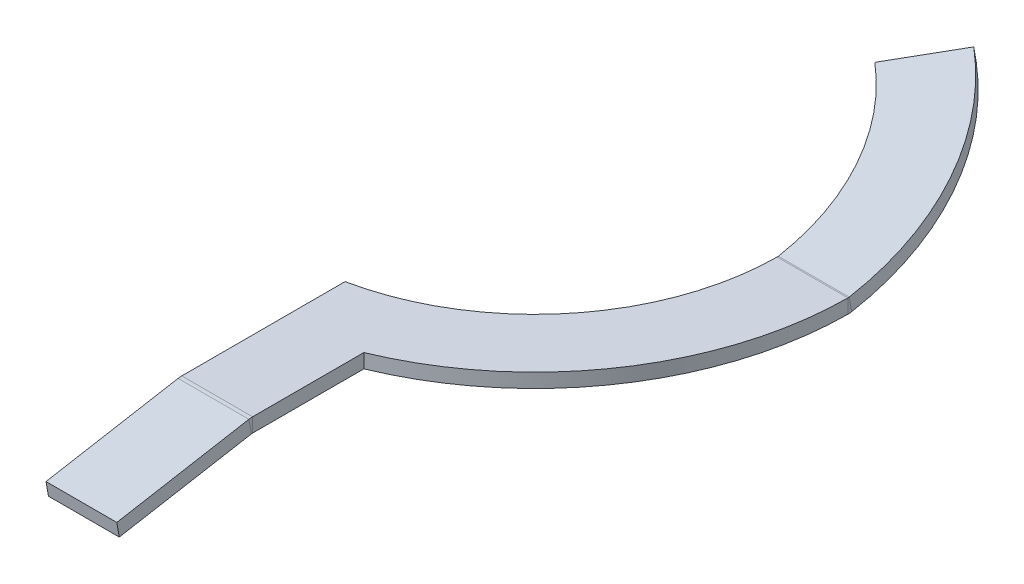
ISO-10303-21;
HEADER;
FILE_DESCRIPTION(('STEP AP214'),'2;1');
FILE_NAME('part.step','',(''),(''),'','','');
FILE_SCHEMA(('AUTOMOTIVE_DESIGN { 1 0 10303 214 1 1 1 1 }'));
ENDSEC;
DATA;
#1=APPLICATION_CONTEXT('core data for automotive mechanical design processes');
#2=APPLICATION_PROTOCOL_DEFINITION('international standard','automotive_design',2000,#1);
#3=PRODUCT_CONTEXT('',#1,'mechanical');
#4=PRODUCT('Part','Part','',(#3));
#5=PRODUCT_RELATED_PRODUCT_CATEGORY('part','',(#4));
#6=PRODUCT_DEFINITION_FORMATION('','',#4);
#7=PRODUCT_DEFINITION_CONTEXT('part definition',#1,'design');
#8=PRODUCT_DEFINITION('design','',#6,#7);
#9=PRODUCT_DEFINITION_SHAPE('','',#8);
#10=(LENGTH_UNIT() NAMED_UNIT(*) SI_UNIT(.MILLI.,.METRE.));
#11=(NAMED_UNIT(*) PLANE_ANGLE_UNIT() SI_UNIT($,.RADIAN.));
#12=(NAMED_UNIT(*) SI_UNIT($,.STERADIAN.) SOLID_ANGLE_UNIT());
#13=UNCERTAINTY_MEASURE_WITH_UNIT(LENGTH_MEASURE(1.E-05),#10,'distance_accuracy_value','');
#14=(GEOMETRIC_REPRESENTATION_CONTEXT(3) GLOBAL_UNCERTAINTY_ASSIGNED_CONTEXT((#13)) GLOBAL_UNIT_ASSIGNED_CONTEXT((#10,
#11,#12)) REPRESENTATION_CONTEXT('',''));
#15=CARTESIAN_POINT('',(0.,0.,0.));
#16=DIRECTION('',(0.,0.,1.));
#17=DIRECTION('',(1.,0.,0.));
#18=AXIS2_PLACEMENT_3D('',#15,#16,#17);
#19=CARTESIAN_POINT('',(-14.,4.,-152.249620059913));
#20=DIRECTION('',(0.,1.,0.));
#21=DIRECTION('',(0.,0.,1.));
#22=AXIS2_PLACEMENT_3D('',#19,#20,#21);
#23=PLANE('',#22);
#24=DIRECTION('',(0.,0.,1.));
#25=VECTOR('',#24,1.);
#26=CARTESIAN_POINT('',(0.,4.,0.));
#27=LINE('',#26,#25);
#28=CARTESIAN_POINT('',(0.,4.,-84.6848363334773));
#29=VERTEX_POINT('',#28);
#30=CARTESIAN_POINT('',(0.,4.,-38.5759841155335));
#31=VERTEX_POINT('',#30);
#32=EDGE_CURVE('E59',#29,#31,#27,.T.);
#33=ORIENTED_EDGE('',*,*,#32,.T.);
#34=DIRECTION('',(1.,0.,0.));
#35=VECTOR('',#34,1.);
#36=CARTESIAN_POINT('',(-14.,4.,-38.5759841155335));
#37=LINE('',#36,#35);
#38=CARTESIAN_POINT('',(20.,3.9999999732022,-38.5759841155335));
#39=VERTEX_POINT('',#38);
#40=EDGE_CURVE('E413',#31,#39,#37,.T.);
#41=ORIENTED_EDGE('',*,*,#40,.T.);
#42=DIRECTION('',(0.,0.,-1.));
#43=VECTOR('',#42,1.);
#44=CARTESIAN_POINT('',(20.,4.,0.));
#45=LINE('',#44,#43);
#46=CARTESIAN_POINT('',(20.,4.,-70.));
#47=VERTEX_POINT('',#46);
#48=EDGE_CURVE('E368',#39,#47,#45,.T.);
#49=ORIENTED_EDGE('',*,*,#48,.T.);
#50=CARTESIAN_POINT('',(-14.,4.,-152.249620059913));
#51=DIRECTION('',(0.,1.,0.));
#52=DIRECTION('',(0.,0.,1.));
#53=AXIS2_PLACEMENT_3D('',#50,#51,#52);
#54=CIRCLE('',#53,89.);
#55=CARTESIAN_POINT('',(74.998451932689,4.,-151.724688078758));
#56=VERTEX_POINT('',#55);
#57=EDGE_CURVE('E343',#47,#56,#54,.T.);
#58=ORIENTED_EDGE('',*,*,#57,.T.);
#59=DIRECTION('',(-1.,0.,0.));
#60=VECTOR('',#59,1.);
#61=CARTESIAN_POINT('',(-14.,4.,-151.724688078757));
#62=LINE('',#61,#60);
#63=CARTESIAN_POINT('',(54.9980032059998,3.99999989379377,-151.724688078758));
#64=VERTEX_POINT('',#63);
#65=EDGE_CURVE('E346',#56,#64,#62,.T.);
#66=ORIENTED_EDGE('',*,*,#65,.T.);
#67=CARTESIAN_POINT('',(-14.,4.,-152.249620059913));
#68=DIRECTION('',(0.,-1.,0.));
#69=DIRECTION('',(0.,0.,1.));
#70=AXIS2_PLACEMENT_3D('',#67,#68,#69);
#71=CIRCLE('',#70,69.);
#72=EDGE_CURVE('E344',#64,#29,#71,.T.);
#73=ORIENTED_EDGE('',*,*,#72,.T.);
#74=EDGE_LOOP('',(#33,#41,#49,#58,#66,#73));
#75=FACE_BOUND('',#74,.T.);
#76=ADVANCED_FACE('F55',(#75),#23,.T.);
#77=CARTESIAN_POINT('',(-14.,4.00030867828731,-151.901416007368));
#78=DIRECTION('',(0.,-0.984807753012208,-0.173648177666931));
#79=DIRECTION('',(0.,0.173648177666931,-0.984807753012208));
#80=AXIS2_PLACEMENT_3D('',#77,#78,#79);
#81=CYLINDRICAL_SURFACE('',#80,89.);
#82=CARTESIAN_POINT('',(-14.,4.00030867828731,-151.901416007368));
#83=DIRECTION('',(0.,0.984807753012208,0.173648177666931));
#84=DIRECTION('',(0.,-0.173648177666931,0.984807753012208));
#85=AXIS2_PLACEMENT_3D('',#82,#83,#84);
#86=CIRCLE('',#85,89.);
#87=CARTESIAN_POINT('',(74.9998314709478,4.03038449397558,-152.071984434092));
#88=VERTEX_POINT('',#87);
#89=CARTESIAN_POINT('',(43.2080972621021,15.8392863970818,-219.043595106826));
#90=VERTEX_POINT('',#89);
#91=EDGE_CURVE('E478',#88,#90,#86,.T.);
#92=ORIENTED_EDGE('',*,*,#91,.F.);
#93=CARTESIAN_POINT('',(74.9998314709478,0.0911533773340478,-152.766577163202));
#94=CARTESIAN_POINT('',(74.9998314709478,4.03038438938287,-152.071984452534));
#95=B_SPLINE_CURVE_WITH_KNOTS('',1,(#93,#94),.UNSPECIFIED.,.F.,.F.,(2,2),(0.,1.),.UNSPECIFIED.);
#96=CARTESIAN_POINT('',(74.9998314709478,0.0911534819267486,-152.766577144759));
#97=VERTEX_POINT('',#96);
#98=EDGE_CURVE('E422',#88,#97,#95,.F.);
#99=ORIENTED_EDGE('',*,*,#98,.T.);
#100=CARTESIAN_POINT('',(-14.,0.0610776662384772,-152.596008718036));
#101=DIRECTION('',(0.,0.984807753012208,0.173648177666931));
#102=DIRECTION('',(0.,-0.173648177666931,0.984807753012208));
#103=AXIS2_PLACEMENT_3D('',#100,#101,#102);
#104=CIRCLE('',#103,89.);
#105=CARTESIAN_POINT('',(43.2080972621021,11.9000553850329,-219.738187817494));
#106=VERTEX_POINT('',#105);
#107=EDGE_CURVE('E372',#97,#106,#104,.T.);
#108=ORIENTED_EDGE('',*,*,#107,.T.);
#109=DIRECTION('',(0.,-0.984807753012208,-0.173648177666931));
#110=VECTOR('',#109,1.);
#111=CARTESIAN_POINT('',(43.2080972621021,15.8392863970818,-219.043595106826));
#112=LINE('',#111,#110);
#113=EDGE_CURVE('E493',#90,#106,#112,.T.);
#114=ORIENTED_EDGE('',*,*,#113,.F.);
#115=EDGE_LOOP('',(#92,#99,#108,#114));
#116=FACE_BOUND('',#115,.T.);
#117=ADVANCED_FACE('F404',(#116),#81,.T.);
#118=CARTESIAN_POINT('',(-14.,4.00030867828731,-151.901416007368));
#119=DIRECTION('',(0.,-0.984807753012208,-0.173648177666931));
#120=DIRECTION('',(0.,0.173648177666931,-0.984807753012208));
#121=AXIS2_PLACEMENT_3D('',#118,#119,#120);
#122=CYLINDRICAL_SURFACE('',#121,69.);
#123=CARTESIAN_POINT('',(-14.,0.0610776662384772,-152.596008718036));
#124=DIRECTION('',(0.,-0.984807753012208,-0.173648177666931));
#125=DIRECTION('',(0.,-0.173648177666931,0.984807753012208));
#126=AXIS2_PLACEMENT_3D('',#123,#124,#125);
#127=CIRCLE('',#126,69.);
#128=CARTESIAN_POINT('',(30.3523450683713,9.23961095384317,-204.650057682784));
#129=VERTEX_POINT('',#128);
#130=CARTESIAN_POINT('',(54.9997826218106,0.091153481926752,-152.766577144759));
#131=VERTEX_POINT('',#130);
#132=EDGE_CURVE('E477',#129,#131,#127,.T.);
#133=ORIENTED_EDGE('',*,*,#132,.T.);
#134=CARTESIAN_POINT('',(54.9997826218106,4.03038438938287,-152.071984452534));
#135=CARTESIAN_POINT('',(54.9997826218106,0.0911533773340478,-152.766577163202));
#136=B_SPLINE_CURVE_WITH_KNOTS('',1,(#134,#135),.UNSPECIFIED.,.F.,.F.,(2,2),(0.,1.),.UNSPECIFIED.);
#137=CARTESIAN_POINT('',(54.9997826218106,4.03038438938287,-152.071984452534));
#138=VERTEX_POINT('',#137);
#139=EDGE_CURVE('E463',#131,#138,#136,.F.);
#140=ORIENTED_EDGE('',*,*,#139,.T.);
#141=CARTESIAN_POINT('',(-14.,4.00030867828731,-151.901416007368));
#142=DIRECTION('',(0.,-0.984807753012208,-0.173648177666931));
#143=DIRECTION('',(0.,-0.173648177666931,0.984807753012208));
#144=AXIS2_PLACEMENT_3D('',#141,#142,#143);
#145=CIRCLE('',#144,69.);
#146=CARTESIAN_POINT('',(30.3523450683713,13.178841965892,-203.955464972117));
#147=VERTEX_POINT('',#146);
#148=EDGE_CURVE('E490',#147,#138,#145,.T.);
#149=ORIENTED_EDGE('',*,*,#148,.F.);
#150=DIRECTION('',(0.,-0.984807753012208,-0.173648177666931));
#151=VECTOR('',#150,1.);
#152=CARTESIAN_POINT('',(30.3523450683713,13.178841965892,-203.955464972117));
#153=LINE('',#152,#151);
#154=EDGE_CURVE('E491',#147,#129,#153,.T.);
#155=ORIENTED_EDGE('',*,*,#154,.T.);
#156=EDGE_LOOP('',(#133,#140,#149,#155));
#157=FACE_BOUND('',#156,.T.);
#158=ADVANCED_FACE('F400',(#157),#122,.F.);
#159=CARTESIAN_POINT('',(-14.,0.0610776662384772,-152.596008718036));
#160=DIRECTION('',(0.,0.984807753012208,0.173648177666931));
#161=DIRECTION('',(0.,-0.173648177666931,0.984807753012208));
#162=AXIS2_PLACEMENT_3D('',#159,#160,#161);
#163=PLANE('',#162);
#164=ORIENTED_EDGE('',*,*,#107,.F.);
#165=DIRECTION('',(-1.,0.,0.));
#166=VECTOR('',#165,1.);
#167=CARTESIAN_POINT('',(-14.,0.0911534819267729,-152.766577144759));
#168=LINE('',#167,#166);
#169=EDGE_CURVE('E461',#97,#131,#168,.T.);
#170=ORIENTED_EDGE('',*,*,#169,.T.);
#171=ORIENTED_EDGE('',*,*,#132,.F.);
#172=DIRECTION('',(-0.64278760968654,-0.133022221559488,0.754406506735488));
#173=VECTOR('',#172,1.);
#174=CARTESIAN_POINT('',(43.2080972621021,11.9000553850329,-219.738187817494));
#175=LINE('',#174,#173);
#176=EDGE_CURVE('E474',#106,#129,#175,.T.);
#177=ORIENTED_EDGE('',*,*,#176,.F.);
#178=EDGE_LOOP('',(#164,#170,#171,#177));
#179=FACE_BOUND('',#178,.T.);
#180=ADVANCED_FACE('F395',(#179),#163,.F.);
#181=CARTESIAN_POINT('',(43.2080972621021,15.8392863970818,-219.043595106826));
#182=DIRECTION('',(0.766044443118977,-0.111618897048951,0.63302222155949));
#183=DIRECTION('',(0.64278760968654,0.133022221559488,-0.754406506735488));
#184=AXIS2_PLACEMENT_3D('',#181,#182,#183);
#185=PLANE('',#184);
#186=ORIENTED_EDGE('',*,*,#176,.T.);
#187=ORIENTED_EDGE('',*,*,#154,.F.);
#188=DIRECTION('',(-0.64278760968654,-0.133022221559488,0.754406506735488));
#189=VECTOR('',#188,1.);
#190=CARTESIAN_POINT('',(43.2080972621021,15.8392863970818,-219.043595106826));
#191=LINE('',#190,#189);
#192=EDGE_CURVE('E481',#90,#147,#191,.T.);
#193=ORIENTED_EDGE('',*,*,#192,.F.);
#194=ORIENTED_EDGE('',*,*,#113,.T.);
#195=EDGE_LOOP('',(#186,#187,#193,#194));
#196=FACE_BOUND('',#195,.T.);
#197=ADVANCED_FACE('F391',(#196),#185,.F.);
#198=CARTESIAN_POINT('',(-14.,4.00030867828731,-151.901416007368));
#199=DIRECTION('',(0.,0.984807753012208,0.173648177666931));
#200=DIRECTION('',(0.,-0.173648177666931,0.984807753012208));
#201=AXIS2_PLACEMENT_3D('',#198,#199,#200);
#202=PLANE('',#201);
#203=DIRECTION('',(-1.,0.,0.));
#204=VECTOR('',#203,1.);
#205=CARTESIAN_POINT('',(-14.,4.03038449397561,-152.071984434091));
#206=LINE('',#205,#204);
#207=EDGE_CURVE('E448',#88,#138,#206,.T.);
#208=ORIENTED_EDGE('',*,*,#207,.F.);
#209=ORIENTED_EDGE('',*,*,#91,.T.);
#210=ORIENTED_EDGE('',*,*,#192,.T.);
#211=ORIENTED_EDGE('',*,*,#148,.T.);
#212=EDGE_LOOP('',(#208,#209,#210,#211));
#213=FACE_BOUND('',#212,.T.);
#214=ADVANCED_FACE('F394',(#213),#202,.T.);
#215=CARTESIAN_POINT('',(20.,4.,0.));
#216=DIRECTION('',(-1.,0.,0.));
#217=DIRECTION('',(0.,0.,1.));
#218=AXIS2_PLACEMENT_3D('',#215,#216,#217);
#219=PLANE('',#218);
#220=DIRECTION('',(0.,1.,0.));
#221=VECTOR('',#220,1.);
#222=CARTESIAN_POINT('',(20.,4.,-38.5759841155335));
#223=LINE('',#222,#221);
#224=CARTESIAN_POINT('',(20.,0.,-38.5759841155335));
#225=VERTEX_POINT('',#224);
#226=EDGE_CURVE('E12',#225,#39,#223,.T.);
#227=ORIENTED_EDGE('',*,*,#226,.F.);
#228=DIRECTION('',(0.,0.,-1.));
#229=VECTOR('',#228,1.);
#230=CARTESIAN_POINT('',(20.,0.,0.));
#231=LINE('',#230,#229);
#232=CARTESIAN_POINT('',(20.,0.,-70.));
#233=VERTEX_POINT('',#232);
#234=EDGE_CURVE('E72',#225,#233,#231,.T.);
#235=ORIENTED_EDGE('',*,*,#234,.T.);
#236=DIRECTION('',(0.,-1.,0.));
#237=VECTOR('',#236,1.);
#238=CARTESIAN_POINT('',(20.,4.,-70.));
#239=LINE('',#238,#237);
#240=EDGE_CURVE('E331',#47,#233,#239,.T.);
#241=ORIENTED_EDGE('',*,*,#240,.F.);
#242=ORIENTED_EDGE('',*,*,#48,.F.);
#243=EDGE_LOOP('',(#227,#235,#241,#242));
#244=FACE_BOUND('',#243,.T.);
#245=ADVANCED_FACE('F57',(#244),#219,.F.);
#246=CARTESIAN_POINT('',(0.,4.,0.));
#247=DIRECTION('',(1.,0.,0.));
#248=DIRECTION('',(0.,0.,-1.));
#249=AXIS2_PLACEMENT_3D('',#246,#247,#248);
#250=PLANE('',#249);
#251=DIRECTION('',(0.,-1.,0.));
#252=VECTOR('',#251,1.);
#253=CARTESIAN_POINT('',(0.,4.,-38.5759841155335));
#254=LINE('',#253,#252);
#255=CARTESIAN_POINT('',(0.,0.,-38.5759841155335));
#256=VERTEX_POINT('',#255);
#257=EDGE_CURVE('E421',#31,#256,#254,.T.);
#258=ORIENTED_EDGE('',*,*,#257,.F.);
#259=ORIENTED_EDGE('',*,*,#32,.F.);
#260=DIRECTION('',(0.,-1.,0.));
#261=VECTOR('',#260,1.);
#262=CARTESIAN_POINT('',(0.,4.,-84.6848363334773));
#263=LINE('',#262,#261);
#264=CARTESIAN_POINT('',(0.,0.,-84.6848363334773));
#265=VERTEX_POINT('',#264);
#266=EDGE_CURVE('E341',#29,#265,#263,.T.);
#267=ORIENTED_EDGE('',*,*,#266,.T.);
#268=DIRECTION('',(0.,0.,1.));
#269=VECTOR('',#268,1.);
#270=CARTESIAN_POINT('',(0.,0.,0.));
#271=LINE('',#270,#269);
#272=EDGE_CURVE('E80',#265,#256,#271,.T.);
#273=ORIENTED_EDGE('',*,*,#272,.T.);
#274=EDGE_LOOP('',(#258,#259,#267,#273));
#275=FACE_BOUND('',#274,.T.);
#276=ADVANCED_FACE('F434',(#275),#250,.F.);
#277=CARTESIAN_POINT('',(-14.,4.,-152.249620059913));
#278=DIRECTION('',(0.,-1.,0.));
#279=DIRECTION('',(0.,0.,-1.));
#280=AXIS2_PLACEMENT_3D('',#277,#278,#279);
#281=CYLINDRICAL_SURFACE('',#280,69.);
#282=CARTESIAN_POINT('',(54.9980032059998,-1.06206226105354E-07,-151.724688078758));
#283=CARTESIAN_POINT('',(54.9980032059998,3.99999989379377,-151.724688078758));
#284=B_SPLINE_CURVE_WITH_KNOTS('',1,(#282,#283),.UNSPECIFIED.,.F.,.F.,(2,2),(0.,1.),.UNSPECIFIED.);
#285=CARTESIAN_POINT('',(54.9980032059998,0.,-151.724688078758));
#286=VERTEX_POINT('',#285);
#287=EDGE_CURVE('E327',#286,#64,#284,.T.);
#288=ORIENTED_EDGE('',*,*,#287,.F.);
#289=CARTESIAN_POINT('',(-14.,0.,-152.249620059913));
#290=DIRECTION('',(0.,-1.,0.));
#291=DIRECTION('',(0.,0.,1.));
#292=AXIS2_PLACEMENT_3D('',#289,#290,#291);
#293=CIRCLE('',#292,69.);
#294=EDGE_CURVE('E340',#286,#265,#293,.T.);
#295=ORIENTED_EDGE('',*,*,#294,.T.);
#296=ORIENTED_EDGE('',*,*,#266,.F.);
#297=ORIENTED_EDGE('',*,*,#72,.F.);
#298=EDGE_LOOP('',(#288,#295,#296,#297));
#299=FACE_BOUND('',#298,.T.);
#300=ADVANCED_FACE('F285',(#299),#281,.F.);
#301=CARTESIAN_POINT('',(-14.,0.,-152.249620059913));
#302=DIRECTION('',(0.,1.,0.));
#303=DIRECTION('',(0.,0.,1.));
#304=AXIS2_PLACEMENT_3D('',#301,#302,#303);
#305=PLANE('',#304);
#306=DIRECTION('',(1.,0.,0.));
#307=VECTOR('',#306,1.);
#308=CARTESIAN_POINT('',(-14.,0.,-38.5759841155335));
#309=LINE('',#308,#307);
#310=EDGE_CURVE('E64',#256,#225,#309,.T.);
#311=ORIENTED_EDGE('',*,*,#310,.F.);
#312=ORIENTED_EDGE('',*,*,#272,.F.);
#313=ORIENTED_EDGE('',*,*,#294,.F.);
#314=DIRECTION('',(-1.,0.,0.));
#315=VECTOR('',#314,1.);
#316=CARTESIAN_POINT('',(-14.,0.,-151.724688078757));
#317=LINE('',#316,#315);
#318=CARTESIAN_POINT('',(74.998451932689,0.,-151.724688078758));
#319=VERTEX_POINT('',#318);
#320=EDGE_CURVE('E358',#319,#286,#317,.T.);
#321=ORIENTED_EDGE('',*,*,#320,.F.);
#322=CARTESIAN_POINT('',(-14.,0.,-152.249620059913));
#323=DIRECTION('',(0.,1.,0.));
#324=DIRECTION('',(0.,0.,1.));
#325=AXIS2_PLACEMENT_3D('',#322,#323,#324);
#326=CIRCLE('',#325,89.);
#327=EDGE_CURVE('E339',#233,#319,#326,.T.);
#328=ORIENTED_EDGE('',*,*,#327,.F.);
#329=ORIENTED_EDGE('',*,*,#234,.F.);
#330=EDGE_LOOP('',(#311,#312,#313,#321,#328,#329));
#331=FACE_BOUND('',#330,.T.);
#332=ADVANCED_FACE('F390',(#331),#305,.F.);
#333=CARTESIAN_POINT('',(-14.,4.,-152.249620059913));
#334=DIRECTION('',(0.,-1.,0.));
#335=DIRECTION('',(0.,0.,-1.));
#336=AXIS2_PLACEMENT_3D('',#333,#334,#335);
#337=CYLINDRICAL_SURFACE('',#336,89.);
#338=CARTESIAN_POINT('',(74.998451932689,3.99999989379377,-151.724688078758));
#339=CARTESIAN_POINT('',(74.998451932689,-1.06206226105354E-07,-151.724688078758));
#340=B_SPLINE_CURVE_WITH_KNOTS('',1,(#338,#339),.UNSPECIFIED.,.F.,.F.,(2,2),(0.,1.),.UNSPECIFIED.);
#341=EDGE_CURVE('E312',#56,#319,#340,.T.);
#342=ORIENTED_EDGE('',*,*,#341,.F.);
#343=ORIENTED_EDGE('',*,*,#57,.F.);
#344=ORIENTED_EDGE('',*,*,#240,.T.);
#345=ORIENTED_EDGE('',*,*,#327,.T.);
#346=EDGE_LOOP('',(#342,#343,#344,#345));
#347=FACE_BOUND('',#346,.T.);
#348=ADVANCED_FACE('F284',(#347),#337,.T.);
#349=CARTESIAN_POINT('',(74.998451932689,-1.06206226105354E-07,-151.724688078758));
#350=CARTESIAN_POINT('',(74.9989117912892,-1.06206225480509E-07,-152.07376343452));
#351=CARTESIAN_POINT('',(74.9993716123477,0.0305370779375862,-152.422805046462));
#352=CARTESIAN_POINT('',(74.9998314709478,0.0911533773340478,-152.766577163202));
#353=CARTESIAN_POINT('',(74.998451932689,3.99999989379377,-151.724688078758));
#354=CARTESIAN_POINT('',(74.998911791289,3.99999989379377,-151.841046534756));
#355=CARTESIAN_POINT('',(74.9993716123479,4.01017895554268,-151.957393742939));
#356=CARTESIAN_POINT('',(74.9998314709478,4.03038438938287,-152.071984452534));
#357=B_SPLINE_SURFACE_WITH_KNOTS('',1,3,((#349,#350,#351,#352),(#353,#354,#355,#356)),
.UNSPECIFIED.,.F.,.F.,.F.,(2,2),(4,4),(0.,1.),(0.,1.),.UNSPECIFIED.);
#358=CARTESIAN_POINT('',(74.998451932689,-1.06206226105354E-07,-151.724688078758));
#359=CARTESIAN_POINT('',(74.9989117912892,-1.06206225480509E-07,-152.07376343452));
#360=CARTESIAN_POINT('',(74.9993716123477,0.0305370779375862,-152.422805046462));
#361=CARTESIAN_POINT('',(74.9998314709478,0.0911533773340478,-152.766577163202));
#362=B_SPLINE_CURVE_WITH_KNOTS('',3,(#358,#359,#360,#361),.UNSPECIFIED.,.F.,.F.,(4,4),(0.,1.),.UNSPECIFIED.);
#363=EDGE_CURVE('E205',#319,#97,#362,.T.);
#364=CARTESIAN_POINT('',(74.9998314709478,4.03038438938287,-152.071984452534));
#365=CARTESIAN_POINT('',(74.9993716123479,4.01017895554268,-151.957393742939));
#366=CARTESIAN_POINT('',(74.998911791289,3.99999989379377,-151.841046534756));
#367=CARTESIAN_POINT('',(74.998451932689,3.99999989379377,-151.724688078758));
#368=B_SPLINE_CURVE_WITH_KNOTS('',3,(#364,#365,#366,#367),.UNSPECIFIED.,.F.,.F.,(4,4),(0.,1.),.UNSPECIFIED.);
#369=EDGE_CURVE('E250',#56,#88,#368,.F.);
#370=ORIENTED_EDGE('',*,*,#341,.T.);
#371=ORIENTED_EDGE('',*,*,#363,.T.);
#372=ORIENTED_EDGE('',*,*,#98,.F.);
#373=ORIENTED_EDGE('',*,*,#369,.F.);
#374=EDGE_LOOP('',(#370,#371,#372,#373));
#375=FACE_BOUND('',#374,.T.);
#376=ADVANCED_FACE('F273',(#375),#357,.F.);
#377=CARTESIAN_POINT('',(54.9997826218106,0.0911533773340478,-152.766577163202));
#378=CARTESIAN_POINT('',(54.9991894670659,0.0305370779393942,-152.422805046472));
#379=CARTESIAN_POINT('',(54.9985963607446,-1.06206225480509E-07,-152.073763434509));
#380=CARTESIAN_POINT('',(54.9980032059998,-1.06206226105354E-07,-151.724688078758));
#381=CARTESIAN_POINT('',(54.9997826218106,4.03038438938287,-152.071984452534));
#382=CARTESIAN_POINT('',(54.9991894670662,4.01017895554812,-151.95739374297));
#383=CARTESIAN_POINT('',(54.9985963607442,3.99999989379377,-151.841046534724));
#384=CARTESIAN_POINT('',(54.9980032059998,3.99999989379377,-151.724688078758));
#385=B_SPLINE_SURFACE_WITH_KNOTS('',1,3,((#377,#378,#379,#380),(#381,#382,#383,#384)),
.UNSPECIFIED.,.F.,.F.,.F.,(2,2),(4,4),(0.,1.),(0.,1.),.UNSPECIFIED.);
#386=CARTESIAN_POINT('',(54.9997826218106,0.0911533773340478,-152.766577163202));
#387=CARTESIAN_POINT('',(54.9991894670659,0.0305370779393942,-152.422805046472));
#388=CARTESIAN_POINT('',(54.9985963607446,-1.06206225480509E-07,-152.073763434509));
#389=CARTESIAN_POINT('',(54.9980032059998,-1.06206226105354E-07,-151.724688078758));
#390=B_SPLINE_CURVE_WITH_KNOTS('',3,(#386,#387,#388,#389),.UNSPECIFIED.,.F.,.F.,(4,4),(0.,1.),.UNSPECIFIED.);
#391=EDGE_CURVE('E454',#131,#286,#390,.T.);
#392=CARTESIAN_POINT('',(54.9980032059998,3.99999989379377,-151.724688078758));
#393=CARTESIAN_POINT('',(54.9985963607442,3.99999989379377,-151.841046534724));
#394=CARTESIAN_POINT('',(54.9991894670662,4.01017895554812,-151.95739374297));
#395=CARTESIAN_POINT('',(54.9997826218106,4.03038438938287,-152.071984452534));
#396=B_SPLINE_CURVE_WITH_KNOTS('',3,(#392,#393,#394,#395),.UNSPECIFIED.,.F.,.F.,(4,4),(0.,1.),.UNSPECIFIED.);
#397=EDGE_CURVE('E447',#138,#64,#396,.F.);
#398=ORIENTED_EDGE('',*,*,#139,.F.);
#399=ORIENTED_EDGE('',*,*,#391,.T.);
#400=ORIENTED_EDGE('',*,*,#287,.T.);
#401=ORIENTED_EDGE('',*,*,#397,.F.);
#402=EDGE_LOOP('',(#398,#399,#400,#401));
#403=FACE_BOUND('',#402,.T.);
#404=ADVANCED_FACE('F223',(#403),#385,.F.);
#405=CARTESIAN_POINT('',(85.4082070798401,6.,-151.724688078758));
#406=DIRECTION('',(-1.,0.,0.));
#407=DIRECTION('',(0.,0.,1.));
#408=AXIS2_PLACEMENT_3D('',#405,#406,#407);
#409=CYLINDRICAL_SURFACE('',#408,2.00000010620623);
#410=ORIENTED_EDGE('',*,*,#397,.T.);
#411=ORIENTED_EDGE('',*,*,#65,.F.);
#412=ORIENTED_EDGE('',*,*,#369,.T.);
#413=ORIENTED_EDGE('',*,*,#207,.T.);
#414=EDGE_LOOP('',(#410,#411,#412,#413));
#415=FACE_BOUND('',#414,.T.);
#416=ADVANCED_FACE('F212',(#415),#409,.F.);
#417=CARTESIAN_POINT('',(85.4082070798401,6.,-151.724688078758));
#418=DIRECTION('',(-1.,0.,0.));
#419=DIRECTION('',(0.,0.,1.));
#420=AXIS2_PLACEMENT_3D('',#417,#418,#419);
#421=CYLINDRICAL_SURFACE('',#420,6.00000010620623);
#422=ORIENTED_EDGE('',*,*,#391,.F.);
#423=ORIENTED_EDGE('',*,*,#169,.F.);
#424=ORIENTED_EDGE('',*,*,#363,.F.);
#425=ORIENTED_EDGE('',*,*,#320,.T.);
#426=EDGE_LOOP('',(#422,#423,#424,#425));
#427=FACE_BOUND('',#426,.T.);
#428=ADVANCED_FACE('F222',(#427),#421,.T.);
#429=CARTESIAN_POINT('',(0.,-1.99999997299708,-38.5759841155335));
#430=DIRECTION('',(-1.,0.,0.));
#431=DIRECTION('',(0.,0.,1.));
#432=AXIS2_PLACEMENT_3D('',#429,#430,#431);
#433=PLANE('',#432);
#434=ORIENTED_EDGE('',*,*,#257,.T.);
#435=CARTESIAN_POINT('',(0.,-2.,-38.5759841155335));
#436=DIRECTION('',(1.,0.,0.));
#437=DIRECTION('',(0.,0.,-1.));
#438=AXIS2_PLACEMENT_3D('',#435,#436,#437);
#439=CIRCLE('',#438,1.99999997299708);
#440=CARTESIAN_POINT('',(0.,-0.030384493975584,-38.2286877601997));
#441=VERTEX_POINT('',#440);
#442=EDGE_CURVE('E196',#256,#441,#439,.T.);
#443=ORIENTED_EDGE('',*,*,#442,.T.);
#444=DIRECTION('',(0.,-0.984807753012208,-0.173648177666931));
#445=VECTOR('',#444,1.);
#446=CARTESIAN_POINT('',(0.,3.90884651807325,-37.5340950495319));
#447=LINE('',#446,#445);
#448=CARTESIAN_POINT('',(0.,3.90884651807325,-37.5340950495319));
#449=VERTEX_POINT('',#448);
#450=EDGE_CURVE('E167',#449,#441,#447,.T.);
#451=ORIENTED_EDGE('',*,*,#450,.F.);
#452=CARTESIAN_POINT('',(0.,-1.99999997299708,-38.5759841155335));
#453=DIRECTION('',(1.,0.,0.));
#454=DIRECTION('',(0.,0.,-1.));
#455=AXIS2_PLACEMENT_3D('',#452,#453,#454);
#456=CIRCLE('',#455,5.99999994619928);
#457=EDGE_CURVE('E195',#31,#449,#456,.T.);
#458=ORIENTED_EDGE('',*,*,#457,.F.);
#459=EDGE_LOOP('',(#434,#443,#451,#458));
#460=FACE_BOUND('',#459,.T.);
#461=ADVANCED_FACE('F437',(#460),#433,.T.);
#462=CARTESIAN_POINT('',(20.,-1.99999997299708,-38.5759841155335));
#463=DIRECTION('',(1.,0.,0.));
#464=DIRECTION('',(0.,0.,-1.));
#465=AXIS2_PLACEMENT_3D('',#462,#463,#464);
#466=PLANE('',#465);
#467=DIRECTION('',(0.,0.984807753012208,0.173648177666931));
#468=VECTOR('',#467,1.);
#469=CARTESIAN_POINT('',(20.,3.90884651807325,-37.5340950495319));
#470=LINE('',#469,#468);
#471=CARTESIAN_POINT('',(20.,-0.030384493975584,-38.2286877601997));
#472=VERTEX_POINT('',#471);
#473=CARTESIAN_POINT('',(20.,3.90884649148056,-37.5340950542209));
#474=VERTEX_POINT('',#473);
#475=EDGE_CURVE('E444',#472,#474,#470,.T.);
#476=ORIENTED_EDGE('',*,*,#475,.F.);
#477=CARTESIAN_POINT('',(20.,-2.,-38.5759841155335));
#478=DIRECTION('',(1.,0.,0.));
#479=DIRECTION('',(0.,0.,-1.));
#480=AXIS2_PLACEMENT_3D('',#477,#478,#479);
#481=CIRCLE('',#480,1.99999997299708);
#482=EDGE_CURVE('E192',#472,#225,#481,.F.);
#483=ORIENTED_EDGE('',*,*,#482,.T.);
#484=ORIENTED_EDGE('',*,*,#226,.T.);
#485=CARTESIAN_POINT('',(20.,-1.99999997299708,-38.5759841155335));
#486=DIRECTION('',(-1.,0.,0.));
#487=DIRECTION('',(0.,0.,1.));
#488=AXIS2_PLACEMENT_3D('',#485,#486,#487);
#489=CIRCLE('',#488,5.99999994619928);
#490=EDGE_CURVE('E202',#474,#39,#489,.T.);
#491=ORIENTED_EDGE('',*,*,#490,.F.);
#492=EDGE_LOOP('',(#476,#483,#484,#491));
#493=FACE_BOUND('',#492,.T.);
#494=ADVANCED_FACE('F443',(#493),#466,.T.);
#495=CARTESIAN_POINT('',(-10.4080226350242,-2.,-38.5759841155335));
#496=DIRECTION('',(1.,0.,0.));
#497=DIRECTION('',(0.,0.,-1.));
#498=AXIS2_PLACEMENT_3D('',#495,#496,#497);
#499=CYLINDRICAL_SURFACE('',#498,5.99999997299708);
#500=ORIENTED_EDGE('',*,*,#490,.T.);
#501=ORIENTED_EDGE('',*,*,#40,.F.);
#502=ORIENTED_EDGE('',*,*,#457,.T.);
#503=DIRECTION('',(1.,0.,0.));
#504=VECTOR('',#503,1.);
#505=CARTESIAN_POINT('',(-14.,3.90884651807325,-37.5340950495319));
#506=LINE('',#505,#504);
#507=EDGE_CURVE('E180',#449,#474,#506,.T.);
#508=ORIENTED_EDGE('',*,*,#507,.T.);
#509=EDGE_LOOP('',(#500,#501,#502,#508));
#510=FACE_BOUND('',#509,.T.);
#511=ADVANCED_FACE('F439',(#510),#499,.T.);
#512=CARTESIAN_POINT('',(-10.4080226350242,-2.,-38.5759841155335));
#513=DIRECTION('',(1.,0.,0.));
#514=DIRECTION('',(0.,0.,-1.));
#515=AXIS2_PLACEMENT_3D('',#512,#513,#514);
#516=CYLINDRICAL_SURFACE('',#515,1.99999997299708);
#517=ORIENTED_EDGE('',*,*,#482,.F.);
#518=DIRECTION('',(1.,0.,0.));
#519=VECTOR('',#518,1.);
#520=CARTESIAN_POINT('',(-14.,-0.030384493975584,-38.2286877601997));
#521=LINE('',#520,#519);
#522=EDGE_CURVE('E171',#441,#472,#521,.T.);
#523=ORIENTED_EDGE('',*,*,#522,.F.);
#524=ORIENTED_EDGE('',*,*,#442,.F.);
#525=ORIENTED_EDGE('',*,*,#310,.T.);
#526=EDGE_LOOP('',(#517,#523,#524,#525));
#527=FACE_BOUND('',#526,.T.);
#528=ADVANCED_FACE('F597',(#527),#516,.F.);
#529=CARTESIAN_POINT('',(0.,-2.66857352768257,-0.231692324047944));
#530=DIRECTION('',(0.,0.173648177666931,-0.984807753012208));
#531=DIRECTION('',(-1.,0.,0.));
#532=AXIS2_PLACEMENT_3D('',#529,#530,#531);
#533=PLANE('',#532);
#534=DIRECTION('',(1.,0.,0.));
#535=VECTOR('',#534,1.);
#536=CARTESIAN_POINT('',(0.,-6.60780453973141,-0.926285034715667));
#537=LINE('',#536,#535);
#538=CARTESIAN_POINT('',(0.,-6.60780453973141,-0.926285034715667));
#539=VERTEX_POINT('',#538);
#540=CARTESIAN_POINT('',(20.,-6.60780453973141,-0.926285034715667));
#541=VERTEX_POINT('',#540);
#542=EDGE_CURVE('E174',#539,#541,#537,.T.);
#543=ORIENTED_EDGE('',*,*,#542,.T.);
#544=DIRECTION('',(0.,-0.984807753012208,-0.173648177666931));
#545=VECTOR('',#544,1.);
#546=CARTESIAN_POINT('',(20.,-2.66857352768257,-0.231692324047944));
#547=LINE('',#546,#545);
#548=CARTESIAN_POINT('',(20.,-2.66857352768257,-0.231692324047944));
#549=VERTEX_POINT('',#548);
#550=EDGE_CURVE('E199',#549,#541,#547,.T.);
#551=ORIENTED_EDGE('',*,*,#550,.F.);
#552=DIRECTION('',(1.,0.,0.));
#553=VECTOR('',#552,1.);
#554=CARTESIAN_POINT('',(0.,-2.66857352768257,-0.231692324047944));
#555=LINE('',#554,#553);
#556=CARTESIAN_POINT('',(0.,-2.66857352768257,-0.231692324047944));
#557=VERTEX_POINT('',#556);
#558=EDGE_CURVE('E184',#557,#549,#555,.T.);
#559=ORIENTED_EDGE('',*,*,#558,.F.);
#560=DIRECTION('',(0.,-0.984807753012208,-0.173648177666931));
#561=VECTOR('',#560,1.);
#562=CARTESIAN_POINT('',(0.,-2.66857352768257,-0.231692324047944));
#563=LINE('',#562,#561);
#564=EDGE_CURVE('E165',#557,#539,#563,.T.);
#565=ORIENTED_EDGE('',*,*,#564,.T.);
#566=EDGE_LOOP('',(#543,#551,#559,#565));
#567=FACE_BOUND('',#566,.T.);
#568=ADVANCED_FACE('F183',(#567),#533,.F.);
#569=CARTESIAN_POINT('',(-14.,23.7692955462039,-150.168298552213));
#570=DIRECTION('',(0.,0.984807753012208,0.173648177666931));
#571=DIRECTION('',(0.,-0.173648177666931,0.984807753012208));
#572=AXIS2_PLACEMENT_3D('',#569,#570,#571);
#573=PLANE('',#572);
#574=ORIENTED_EDGE('',*,*,#507,.F.);
#575=DIRECTION('',(0.,-0.173648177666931,0.984807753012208));
#576=VECTOR('',#575,1.);
#577=CARTESIAN_POINT('',(0.,-2.66857352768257,-0.231692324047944));
#578=LINE('',#577,#576);
#579=EDGE_CURVE('E185',#449,#557,#578,.T.);
#580=ORIENTED_EDGE('',*,*,#579,.T.);
#581=ORIENTED_EDGE('',*,*,#558,.T.);
#582=DIRECTION('',(0.,0.173648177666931,-0.984807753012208));
#583=VECTOR('',#582,1.);
#584=CARTESIAN_POINT('',(20.,-2.66857352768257,-0.231692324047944));
#585=LINE('',#584,#583);
#586=EDGE_CURVE('E757',#549,#474,#585,.T.);
#587=ORIENTED_EDGE('',*,*,#586,.T.);
#588=EDGE_LOOP('',(#574,#580,#581,#587));
#589=FACE_BOUND('',#588,.T.);
#590=ADVANCED_FACE('F618',(#589),#573,.T.);
#591=CARTESIAN_POINT('',(0.,-2.66857352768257,-0.231692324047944));
#592=DIRECTION('',(1.,0.,0.));
#593=DIRECTION('',(0.,0.173648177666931,-0.984807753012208));
#594=AXIS2_PLACEMENT_3D('',#591,#592,#593);
#595=PLANE('',#594);
#596=ORIENTED_EDGE('',*,*,#579,.F.);
#597=ORIENTED_EDGE('',*,*,#450,.T.);
#598=DIRECTION('',(0.,-0.173648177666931,0.984807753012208));
#599=VECTOR('',#598,1.);
#600=CARTESIAN_POINT('',(0.,-6.60780453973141,-0.926285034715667));
#601=LINE('',#600,#599);
#602=EDGE_CURVE('E160',#441,#539,#601,.T.);
#603=ORIENTED_EDGE('',*,*,#602,.T.);
#604=ORIENTED_EDGE('',*,*,#564,.F.);
#605=EDGE_LOOP('',(#596,#597,#603,#604));
#606=FACE_BOUND('',#605,.T.);
#607=ADVANCED_FACE('F163',(#606),#595,.F.);
#608=CARTESIAN_POINT('',(-14.,19.830064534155,-150.862891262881));
#609=DIRECTION('',(0.,0.984807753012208,0.173648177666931));
#610=DIRECTION('',(0.,-0.173648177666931,0.984807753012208));
#611=AXIS2_PLACEMENT_3D('',#608,#609,#610);
#612=PLANE('',#611);
#613=ORIENTED_EDGE('',*,*,#602,.F.);
#614=ORIENTED_EDGE('',*,*,#522,.T.);
#615=DIRECTION('',(0.,0.173648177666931,-0.984807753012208));
#616=VECTOR('',#615,1.);
#617=CARTESIAN_POINT('',(20.,-6.60780453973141,-0.926285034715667));
#618=LINE('',#617,#616);
#619=EDGE_CURVE('E176',#541,#472,#618,.T.);
#620=ORIENTED_EDGE('',*,*,#619,.F.);
#621=ORIENTED_EDGE('',*,*,#542,.F.);
#622=EDGE_LOOP('',(#613,#614,#620,#621));
#623=FACE_BOUND('',#622,.T.);
#624=ADVANCED_FACE('F175',(#623),#612,.F.);
#625=CARTESIAN_POINT('',(20.,-2.66857352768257,-0.231692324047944));
#626=DIRECTION('',(-1.,0.,0.));
#627=DIRECTION('',(0.,-0.173648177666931,0.984807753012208));
#628=AXIS2_PLACEMENT_3D('',#625,#626,#627);
#629=PLANE('',#628);
#630=ORIENTED_EDGE('',*,*,#619,.T.);
#631=ORIENTED_EDGE('',*,*,#475,.T.);
#632=ORIENTED_EDGE('',*,*,#586,.F.);
#633=ORIENTED_EDGE('',*,*,#550,.T.);
#634=EDGE_LOOP('',(#630,#631,#632,#633));
#635=FACE_BOUND('',#634,.T.);
#636=ADVANCED_FACE('F648',(#635),#629,.F.);
#637=CLOSED_SHELL('',(#76,#117,#158,#180,#197,#214,#245,#276,#300,#332,#348,#376,#404,#416,#428,
#461,#494,#511,#528,#568,#590,#607,#624,#636));
#638=MANIFOLD_SOLID_BREP('B2',#637);
#639=ADVANCED_BREP_SHAPE_REPRESENTATION('',(#18,#638),#14);
#640=SHAPE_DEFINITION_REPRESENTATION(#9,#639);
ENDSEC;
END-ISO-10303-21;
